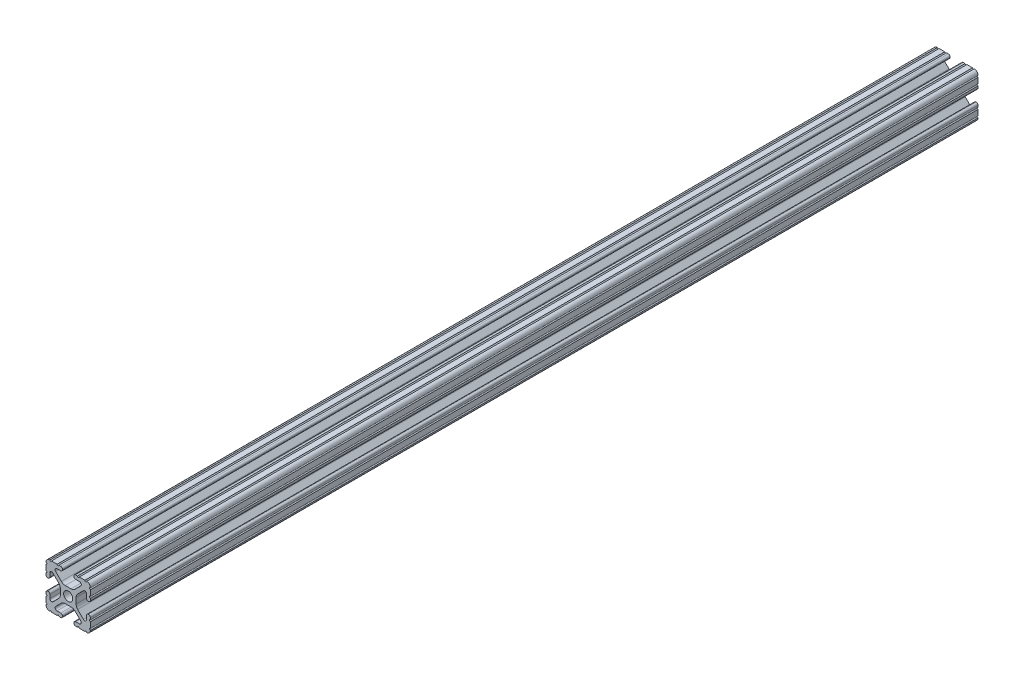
from build123d import *

# Parameters (mm, degrees)
SKETCH1_R      = 2.6035
EXTRUDE1_DEPTH = 508


with BuildPart() as part:
    # Sketch1 → Extrude1 (new body)
    with BuildSketch(Plane.XY):
        with BuildLine():
            Line((-7.207036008, 8.724370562), (-3.898272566, 5.423169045))
            ThreePointArc((-3.898272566, 5.423169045), (-2.869120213, 4.736787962), (-1.655778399, 4.4958))
            Line((-1.655778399, 4.4958), (1.655778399, 4.4958))
            ThreePointArc((1.655778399, 4.4958), (2.869120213, 4.736787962), (3.898272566, 5.423169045))
            Line((3.898272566, 5.423169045), (7.207036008, 8.724370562))
            ThreePointArc((7.207036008, 8.724370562), (7.432222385, 9.85140422), (6.476788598, 10.4902))
            Line((6.476788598, 10.4902), (4.287512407, 10.4902))
            ThreePointArc((4.287512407, 10.4902), (3.54574862, 10.79744862), (3.2385, 11.539212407))
            Line((3.2385, 11.539212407), (3.2385, 11.650987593))
            ThreePointArc((3.2385, 11.650987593), (3.54574862, 12.39275138), (4.287512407, 12.7))
            Line((4.287512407, 12.7), (5.317126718, 12.7))
            ThreePointArc((5.317126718, 12.7), (5.825126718, 12.192), (6.333126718, 12.7))
            Line((6.333126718, 12.7), (9.550443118, 12.7))
            ThreePointArc((9.550443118, 12.7), (10.058366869, 12.192000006), (10.566443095, 12.699847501))
            ThreePointArc((10.566443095, 12.699847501), (12.082537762, 12.08250727), (12.699846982, 10.566399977))
            ThreePointArc((12.699846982, 10.566399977), (12.192000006, 10.058323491), (12.7, 9.5504))
            Line((12.7, 9.5504), (12.7, 6.3330836))
            ThreePointArc((12.7, 6.3330836), (12.192, 5.8250836), (12.7, 5.3170836))
            Line((12.7, 5.3170836), (12.7, 4.287469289))
            ThreePointArc((12.7, 4.287469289), (12.39275138, 3.545705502), (11.650987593, 3.238456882))
            Line((11.650987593, 3.238456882), (11.539212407, 3.238456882))
            ThreePointArc((11.539212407, 3.238456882), (10.79744862, 3.545705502), (10.4902, 4.287469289))
            Line((10.4902, 4.287469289), (10.4902, 6.402089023))
            ThreePointArc((10.4902, 6.402089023), (9.856505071, 7.351067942), (8.737131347, 7.129408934))
            Line((8.737131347, 7.129408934), (5.441005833, 3.840816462))
            ThreePointArc((5.441005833, 3.840816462), (4.750877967, 2.809883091), (4.5085, 1.593185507))
            Line((4.5085, 1.593185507), (4.5085, -1.593185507))
            ThreePointArc((4.5085, -1.593185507), (4.750877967, -2.809883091), (5.441005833, -3.840816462))
            Line((5.441005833, -3.840816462), (8.737131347, -7.129408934))
            ThreePointArc((8.737131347, -7.129408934), (9.856505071, -7.351067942), (10.4902, -6.402089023))
            Line((10.4902, -6.402089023), (10.4902, -4.287469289))
            ThreePointArc((10.4902, -4.287469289), (10.79744862, -3.545705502), (11.539212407, -3.238456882))
            Line((11.539212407, -3.238456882), (11.650987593, -3.238456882))
            ThreePointArc((11.650987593, -3.238456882), (12.39275138, -3.545705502), (12.7, -4.287469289))
            Line((12.7, -4.287469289), (12.7, -5.3170836))
            ThreePointArc((12.7, -5.3170836), (12.192, -5.8250836), (12.7, -6.3330836))
            Line((12.7, -6.3330836), (12.7, -9.5504))
            ThreePointArc((12.7, -9.5504), (12.192000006, -10.058323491), (12.699846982, -10.566399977))
            ThreePointArc((12.699846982, -10.566399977), (12.082537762, -12.08250727), (10.566443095, -12.699847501))
            ThreePointArc((10.566443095, -12.699847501), (10.058366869, -12.192000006), (9.550443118, -12.7))
            Line((9.550443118, -12.7), (6.333126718, -12.7))
            ThreePointArc((6.333126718, -12.7), (5.825126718, -12.192), (5.317126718, -12.7))
            Line((5.317126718, -12.7), (4.287512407, -12.7))
            ThreePointArc((4.287512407, -12.7), (3.54574862, -12.39275138), (3.2385, -11.650987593))
            Line((3.2385, -11.650987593), (3.2385, -11.539212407))
            ThreePointArc((3.2385, -11.539212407), (3.54574862, -10.79744862), (4.287512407, -10.4902))
            Line((4.287512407, -10.4902), (6.416408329, -10.4902))
            ThreePointArc((6.416408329, -10.4902), (7.41473083, -9.822813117), (7.179650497, -8.645192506))
            Line((7.179650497, -8.645192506), (3.952270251, -5.423690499))
            ThreePointArc((3.952270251, -5.423690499), (2.922936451, -4.736929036), (1.709253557, -4.4958))
            Line((1.709253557, -4.4958), (-1.709253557, -4.4958))
            ThreePointArc((-1.709253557, -4.4958), (-2.922936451, -4.736929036), (-3.952270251, -5.423690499))
            Line((-3.952270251, -5.423690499), (-7.179650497, -8.645192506))
            ThreePointArc((-7.179650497, -8.645192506), (-7.41473083, -9.822813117), (-6.416408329, -10.4902))
            Line((-6.416408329, -10.4902), (-4.287512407, -10.4902))
            ThreePointArc((-4.287512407, -10.4902), (-3.54574862, -10.79744862), (-3.2385, -11.539212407))
            Line((-3.2385, -11.539212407), (-3.2385, -11.650987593))
            ThreePointArc((-3.2385, -11.650987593), (-3.54574862, -12.39275138), (-4.287512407, -12.7))
            Line((-4.287512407, -12.7), (-5.317126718, -12.7))
            ThreePointArc((-5.317126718, -12.7), (-5.825126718, -12.192), (-6.333126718, -12.7))
            Line((-6.333126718, -12.7), (-9.550443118, -12.7))
            ThreePointArc((-9.550443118, -12.7), (-10.058366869, -12.192000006), (-10.566443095, -12.699847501))
            ThreePointArc((-10.566443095, -12.699847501), (-12.082537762, -12.08250727), (-12.699846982, -10.566399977))
            ThreePointArc((-12.699846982, -10.566399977), (-12.192000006, -10.058323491), (-12.7, -9.5504))
            Line((-12.7, -9.5504), (-12.7, -6.3330836))
            ThreePointArc((-12.7, -6.3330836), (-12.192, -5.8250836), (-12.7, -5.3170836))
            Line((-12.7, -5.3170836), (-12.7, -4.287469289))
            ThreePointArc((-12.7, -4.287469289), (-12.39275138, -3.545705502), (-11.650987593, -3.238456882))
            Line((-11.650987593, -3.238456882), (-11.539212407, -3.238456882))
            ThreePointArc((-11.539212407, -3.238456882), (-10.79744862, -3.545705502), (-10.4902, -4.287469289))
            Line((-10.4902, -4.287469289), (-10.4902, -6.402089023))
            ThreePointArc((-10.4902, -6.402089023), (-9.856505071, -7.351067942), (-8.737131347, -7.129408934))
            Line((-8.737131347, -7.129408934), (-5.441005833, -3.840816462))
            ThreePointArc((-5.441005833, -3.840816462), (-4.750877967, -2.809883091), (-4.5085, -1.593185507))
            Line((-4.5085, -1.593185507), (-4.5085, 1.593185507))
            ThreePointArc((-4.5085, 1.593185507), (-4.750877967, 2.809883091), (-5.441005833, 3.840816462))
            Line((-5.441005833, 3.840816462), (-8.737131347, 7.129408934))
            ThreePointArc((-8.737131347, 7.129408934), (-9.856505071, 7.351067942), (-10.4902, 6.402089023))
            Line((-10.4902, 6.402089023), (-10.4902, 4.287469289))
            ThreePointArc((-10.4902, 4.287469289), (-10.79744862, 3.545705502), (-11.539212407, 3.238456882))
            Line((-11.539212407, 3.238456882), (-11.650987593, 3.238456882))
            ThreePointArc((-11.650987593, 3.238456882), (-12.39275138, 3.545705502), (-12.7, 4.287469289))
            Line((-12.7, 4.287469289), (-12.7, 5.3170836))
            ThreePointArc((-12.7, 5.3170836), (-12.192, 5.8250836), (-12.7, 6.3330836))
            Line((-12.7, 6.3330836), (-12.7, 9.5504))
            ThreePointArc((-12.7, 9.5504), (-12.192000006, 10.058323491), (-12.699846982, 10.566399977))
            ThreePointArc((-12.699846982, 10.566399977), (-12.082537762, 12.08250727), (-10.566443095, 12.699847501))
            ThreePointArc((-10.566443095, 12.699847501), (-10.058366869, 12.192000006), (-9.550443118, 12.7))
            Line((-9.550443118, 12.7), (-6.333126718, 12.7))
            ThreePointArc((-6.333126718, 12.7), (-5.825126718, 12.192), (-5.317126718, 12.7))
            Line((-5.317126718, 12.7), (-4.287512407, 12.7))
            ThreePointArc((-4.287512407, 12.7), (-3.54574862, 12.39275138), (-3.2385, 11.650987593))
            Line((-3.2385, 11.650987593), (-3.2385, 11.539212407))
            ThreePointArc((-3.2385, 11.539212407), (-3.54574862, 10.79744862), (-4.287512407, 10.4902))
            Line((-4.287512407, 10.4902), (-6.476788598, 10.4902))
            ThreePointArc((-6.476788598, 10.4902), (-7.432222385, 9.85140422), (-7.207036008, 8.724370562))
        make_face()
        Circle(SKETCH1_R, mode=Mode.SUBTRACT)
    extrude(amount=-EXTRUDE1_DEPTH)


solid = part.part
